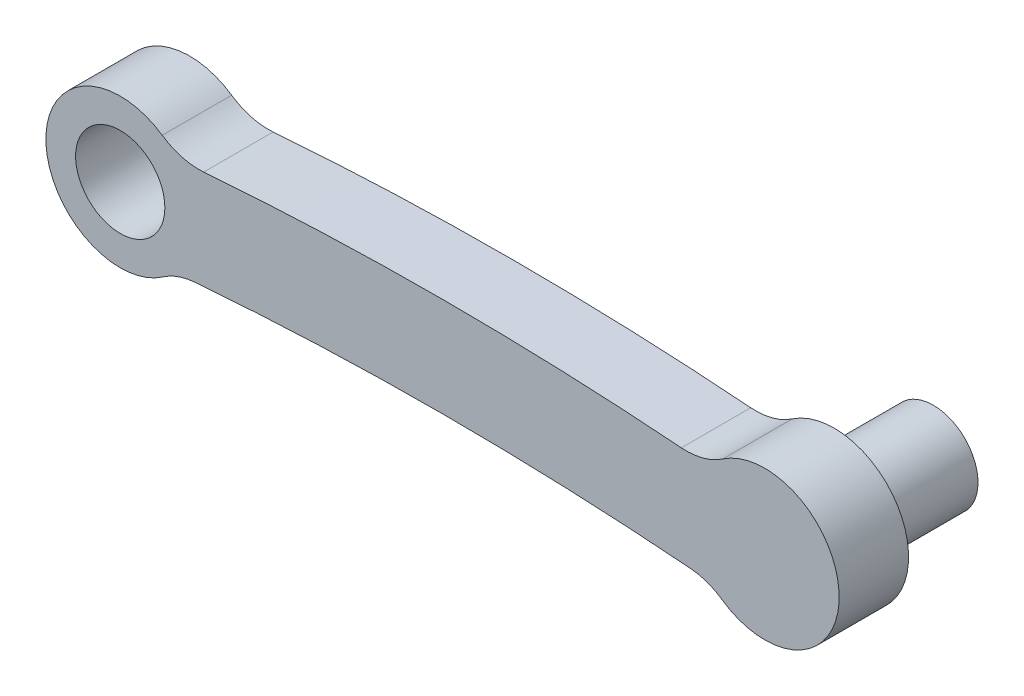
ISO-10303-21;
HEADER;
FILE_DESCRIPTION(('STEP AP214'),'2;1');
FILE_NAME('part.step','',(''),(''),'','','');
FILE_SCHEMA(('AUTOMOTIVE_DESIGN { 1 0 10303 214 1 1 1 1 }'));
ENDSEC;
DATA;
#1=APPLICATION_CONTEXT('core data for automotive mechanical design processes');
#2=APPLICATION_PROTOCOL_DEFINITION('international standard','automotive_design',2000,#1);
#3=PRODUCT_CONTEXT('',#1,'mechanical');
#4=PRODUCT('Part','Part','',(#3));
#5=PRODUCT_RELATED_PRODUCT_CATEGORY('part','',(#4));
#6=PRODUCT_DEFINITION_FORMATION('','',#4);
#7=PRODUCT_DEFINITION_CONTEXT('part definition',#1,'design');
#8=PRODUCT_DEFINITION('design','',#6,#7);
#9=PRODUCT_DEFINITION_SHAPE('','',#8);
#10=(LENGTH_UNIT() NAMED_UNIT(*) SI_UNIT(.MILLI.,.METRE.));
#11=(NAMED_UNIT(*) PLANE_ANGLE_UNIT() SI_UNIT($,.RADIAN.));
#12=(NAMED_UNIT(*) SI_UNIT($,.STERADIAN.) SOLID_ANGLE_UNIT());
#13=UNCERTAINTY_MEASURE_WITH_UNIT(LENGTH_MEASURE(1.E-05),#10,'distance_accuracy_value','');
#14=(GEOMETRIC_REPRESENTATION_CONTEXT(3) GLOBAL_UNCERTAINTY_ASSIGNED_CONTEXT((#13)) GLOBAL_UNIT_ASSIGNED_CONTEXT((#10,
#11,#12)) REPRESENTATION_CONTEXT('',''));
#15=CARTESIAN_POINT('',(0.,0.,0.));
#16=DIRECTION('',(0.,0.,1.));
#17=DIRECTION('',(1.,0.,0.));
#18=AXIS2_PLACEMENT_3D('',#15,#16,#17);
#19=CARTESIAN_POINT('',(-344.87892941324,59.7384303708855,48.1847067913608));
#20=DIRECTION('',(0.,0.,-1.));
#21=DIRECTION('',(-1.,0.,0.));
#22=AXIS2_PLACEMENT_3D('',#19,#20,#21);
#23=CYLINDRICAL_SURFACE('',#22,32.6041666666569);
#24=CARTESIAN_POINT('',(-344.87892941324,59.7384303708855,13.1847067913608));
#25=DIRECTION('',(0.,0.,1.));
#26=DIRECTION('',(1.,0.,0.));
#27=AXIS2_PLACEMENT_3D('',#24,#25,#26);
#28=CIRCLE('',#27,32.6041666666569);
#29=CARTESIAN_POINT('',(-363.28298745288,32.8251932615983,13.1847067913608));
#30=VERTEX_POINT('',#29);
#31=CARTESIAN_POINT('',(-342.370187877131,27.2309250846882,13.1847067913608));
#32=VERTEX_POINT('',#31);
#33=EDGE_CURVE('E150',#30,#32,#28,.T.);
#34=ORIENTED_EDGE('',*,*,#33,.F.);
#35=DIRECTION('',(0.,0.,-1.));
#36=VECTOR('',#35,1.);
#37=CARTESIAN_POINT('',(-363.28298745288,32.8251932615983,48.1847067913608));
#38=LINE('',#37,#36);
#39=CARTESIAN_POINT('',(-363.28298745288,32.8251932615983,48.1847067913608));
#40=VERTEX_POINT('',#39);
#41=EDGE_CURVE('E60',#40,#30,#38,.T.);
#42=ORIENTED_EDGE('',*,*,#41,.F.);
#43=CARTESIAN_POINT('',(-344.87892941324,59.7384303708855,48.1847067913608));
#44=DIRECTION('',(0.,0.,1.));
#45=DIRECTION('',(1.,0.,0.));
#46=AXIS2_PLACEMENT_3D('',#43,#44,#45);
#47=CIRCLE('',#46,32.6041666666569);
#48=CARTESIAN_POINT('',(-342.370187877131,27.2309250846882,48.1847067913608));
#49=VERTEX_POINT('',#48);
#50=EDGE_CURVE('E174',#40,#49,#47,.T.);
#51=ORIENTED_EDGE('',*,*,#50,.T.);
#52=DIRECTION('',(0.,0.,-1.));
#53=VECTOR('',#52,1.);
#54=CARTESIAN_POINT('',(-342.370187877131,27.2309250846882,48.1847067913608));
#55=LINE('',#54,#53);
#56=EDGE_CURVE('E68',#49,#32,#55,.T.);
#57=ORIENTED_EDGE('',*,*,#56,.T.);
#58=EDGE_LOOP('',(#34,#42,#51,#57));
#59=FACE_BOUND('',#58,.T.);
#60=ADVANCED_FACE('F52',(#59),#23,.F.);
#61=CARTESIAN_POINT('',(-384.450594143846,1.87067134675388,48.1847067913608));
#62=DIRECTION('',(0.,0.,-1.));
#63=DIRECTION('',(-1.,0.,0.));
#64=AXIS2_PLACEMENT_3D('',#61,#62,#63);
#65=CYLINDRICAL_SURFACE('',#64,37.5);
#66=CARTESIAN_POINT('',(-384.450594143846,1.87067134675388,13.1847067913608));
#67=DIRECTION('',(0.,0.,1.));
#68=DIRECTION('',(1.,0.,0.));
#69=AXIS2_PLACEMENT_3D('',#66,#67,#68);
#70=CIRCLE('',#69,37.5);
#71=CARTESIAN_POINT('',(-362.998142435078,-28.8871295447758,13.1847067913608));
#72=VERTEX_POINT('',#71);
#73=EDGE_CURVE('E152',#30,#72,#70,.T.);
#74=ORIENTED_EDGE('',*,*,#73,.T.);
#75=DIRECTION('',(0.,0.,-1.));
#76=VECTOR('',#75,1.);
#77=CARTESIAN_POINT('',(-362.998142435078,-28.8871295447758,48.1847067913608));
#78=LINE('',#77,#76);
#79=CARTESIAN_POINT('',(-362.998142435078,-28.8871295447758,48.1847067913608));
#80=VERTEX_POINT('',#79);
#81=EDGE_CURVE('E182',#80,#72,#78,.T.);
#82=ORIENTED_EDGE('',*,*,#81,.F.);
#83=CARTESIAN_POINT('',(-384.450594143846,1.87067134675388,48.1847067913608));
#84=DIRECTION('',(0.,0.,1.));
#85=DIRECTION('',(1.,0.,0.));
#86=AXIS2_PLACEMENT_3D('',#83,#84,#85);
#87=CIRCLE('',#86,37.5);
#88=EDGE_CURVE('E187',#40,#80,#87,.T.);
#89=ORIENTED_EDGE('',*,*,#88,.F.);
#90=ORIENTED_EDGE('',*,*,#41,.T.);
#91=EDGE_LOOP('',(#74,#82,#89,#90));
#92=FACE_BOUND('',#91,.T.);
#93=ADVANCED_FACE('F185',(#92),#65,.T.);
#94=CARTESIAN_POINT('',(-344.346427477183,-55.6293286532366,48.1847067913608));
#95=DIRECTION('',(0.,0.,-1.));
#96=DIRECTION('',(-1.,0.,0.));
#97=AXIS2_PLACEMENT_3D('',#94,#95,#96);
#98=CYLINDRICAL_SURFACE('',#97,32.6041666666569);
#99=CARTESIAN_POINT('',(-344.346427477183,-55.6293286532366,13.1847067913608));
#100=DIRECTION('',(0.,0.,1.));
#101=DIRECTION('',(1.,0.,0.));
#102=AXIS2_PLACEMENT_3D('',#99,#100,#101);
#103=CIRCLE('',#102,32.6041666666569);
#104=CARTESIAN_POINT('',(-346.950594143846,-23.129328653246,13.1847067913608));
#105=VERTEX_POINT('',#104);
#106=EDGE_CURVE('E156',#105,#72,#103,.T.);
#107=ORIENTED_EDGE('',*,*,#106,.F.);
#108=DIRECTION('',(0.,0.,-1.));
#109=VECTOR('',#108,1.);
#110=CARTESIAN_POINT('',(-346.950594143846,-23.129328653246,48.1847067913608));
#111=LINE('',#110,#109);
#112=CARTESIAN_POINT('',(-346.950594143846,-23.129328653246,48.1847067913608));
#113=VERTEX_POINT('',#112);
#114=EDGE_CURVE('E180',#113,#105,#111,.T.);
#115=ORIENTED_EDGE('',*,*,#114,.F.);
#116=CARTESIAN_POINT('',(-344.346427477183,-55.6293286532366,48.1847067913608));
#117=DIRECTION('',(0.,0.,1.));
#118=DIRECTION('',(1.,0.,0.));
#119=AXIS2_PLACEMENT_3D('',#116,#117,#118);
#120=CIRCLE('',#119,32.6041666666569);
#121=EDGE_CURVE('E243',#113,#80,#120,.T.);
#122=ORIENTED_EDGE('',*,*,#121,.T.);
#123=ORIENTED_EDGE('',*,*,#81,.T.);
#124=EDGE_LOOP('',(#107,#115,#122,#123));
#125=FACE_BOUND('',#124,.T.);
#126=ADVANCED_FACE('F197',(#125),#98,.F.);
#127=CARTESIAN_POINT('',(-221.950594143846,-1583.12932865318,48.1847067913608));
#128=DIRECTION('',(0.,0.,-1.));
#129=DIRECTION('',(-1.,0.,0.));
#130=AXIS2_PLACEMENT_3D('',#127,#128,#129);
#131=CYLINDRICAL_SURFACE('',#130,1564.99999999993);
#132=CARTESIAN_POINT('',(-221.950594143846,-1583.12932865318,13.1847067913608));
#133=DIRECTION('',(0.,0.,1.));
#134=DIRECTION('',(1.,0.,0.));
#135=AXIS2_PLACEMENT_3D('',#132,#133,#134);
#136=CIRCLE('',#135,1564.99999999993);
#137=CARTESIAN_POINT('',(-96.950594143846,-23.129328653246,13.1847067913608));
#138=VERTEX_POINT('',#137);
#139=EDGE_CURVE('E159',#105,#138,#136,.F.);
#140=ORIENTED_EDGE('',*,*,#139,.T.);
#141=DIRECTION('',(0.,0.,-1.));
#142=VECTOR('',#141,1.);
#143=CARTESIAN_POINT('',(-96.950594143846,-23.129328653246,48.1847067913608));
#144=LINE('',#143,#142);
#145=CARTESIAN_POINT('',(-96.950594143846,-23.129328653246,48.1847067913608));
#146=VERTEX_POINT('',#145);
#147=EDGE_CURVE('E178',#146,#138,#144,.T.);
#148=ORIENTED_EDGE('',*,*,#147,.F.);
#149=CARTESIAN_POINT('',(-221.950594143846,-1583.12932865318,48.1847067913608));
#150=DIRECTION('',(0.,0.,1.));
#151=DIRECTION('',(1.,0.,0.));
#152=AXIS2_PLACEMENT_3D('',#149,#150,#151);
#153=CIRCLE('',#152,1564.99999999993);
#154=EDGE_CURVE('E246',#113,#146,#153,.F.);
#155=ORIENTED_EDGE('',*,*,#154,.F.);
#156=ORIENTED_EDGE('',*,*,#114,.T.);
#157=EDGE_LOOP('',(#140,#148,#155,#156));
#158=FACE_BOUND('',#157,.T.);
#159=ADVANCED_FACE('F201',(#158),#131,.F.);
#160=CARTESIAN_POINT('',(-99.5547608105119,-55.6293286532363,48.1847067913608));
#161=DIRECTION('',(0.,0.,-1.));
#162=DIRECTION('',(-1.,0.,0.));
#163=AXIS2_PLACEMENT_3D('',#160,#161,#162);
#164=CYLINDRICAL_SURFACE('',#163,32.6041666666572);
#165=CARTESIAN_POINT('',(-99.5547608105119,-55.6293286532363,13.1847067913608));
#166=DIRECTION('',(0.,0.,1.));
#167=DIRECTION('',(1.,0.,0.));
#168=AXIS2_PLACEMENT_3D('',#165,#166,#167);
#169=CIRCLE('',#168,32.6041666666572);
#170=CARTESIAN_POINT('',(-80.903045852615,-28.8871295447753,13.1847067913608));
#171=VERTEX_POINT('',#170);
#172=EDGE_CURVE('E162',#171,#138,#169,.T.);
#173=ORIENTED_EDGE('',*,*,#172,.F.);
#174=DIRECTION('',(0.,0.,-1.));
#175=VECTOR('',#174,1.);
#176=CARTESIAN_POINT('',(-80.903045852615,-28.8871295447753,48.1847067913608));
#177=LINE('',#176,#175);
#178=CARTESIAN_POINT('',(-80.903045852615,-28.8871295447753,48.1847067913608));
#179=VERTEX_POINT('',#178);
#180=EDGE_CURVE('E139',#179,#171,#177,.T.);
#181=ORIENTED_EDGE('',*,*,#180,.F.);
#182=CARTESIAN_POINT('',(-99.5547608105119,-55.6293286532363,48.1847067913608));
#183=DIRECTION('',(0.,0.,1.));
#184=DIRECTION('',(1.,0.,0.));
#185=AXIS2_PLACEMENT_3D('',#182,#183,#184);
#186=CIRCLE('',#185,32.6041666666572);
#187=EDGE_CURVE('E129',#179,#146,#186,.T.);
#188=ORIENTED_EDGE('',*,*,#187,.T.);
#189=ORIENTED_EDGE('',*,*,#147,.T.);
#190=EDGE_LOOP('',(#173,#181,#188,#189));
#191=FACE_BOUND('',#190,.T.);
#192=ADVANCED_FACE('F207',(#191),#164,.F.);
#193=CARTESIAN_POINT('',(-59.4505941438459,1.87067134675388,48.1847067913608));
#194=DIRECTION('',(0.,0.,-1.));
#195=DIRECTION('',(-1.,0.,0.));
#196=AXIS2_PLACEMENT_3D('',#193,#194,#195);
#197=CYLINDRICAL_SURFACE('',#196,37.5);
#198=CARTESIAN_POINT('',(-59.4505941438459,1.87067134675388,13.1847067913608));
#199=DIRECTION('',(0.,0.,1.));
#200=DIRECTION('',(1.,0.,0.));
#201=AXIS2_PLACEMENT_3D('',#198,#199,#200);
#202=CIRCLE('',#201,37.5);
#203=CARTESIAN_POINT('',(-80.6182008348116,32.8251932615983,13.1847067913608));
#204=VERTEX_POINT('',#203);
#205=EDGE_CURVE('E136',#171,#204,#202,.T.);
#206=ORIENTED_EDGE('',*,*,#205,.T.);
#207=DIRECTION('',(0.,0.,-1.));
#208=VECTOR('',#207,1.);
#209=CARTESIAN_POINT('',(-80.6182008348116,32.8251932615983,48.1847067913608));
#210=LINE('',#209,#208);
#211=CARTESIAN_POINT('',(-80.6182008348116,32.8251932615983,48.1847067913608));
#212=VERTEX_POINT('',#211);
#213=EDGE_CURVE('E133',#212,#204,#210,.T.);
#214=ORIENTED_EDGE('',*,*,#213,.F.);
#215=CARTESIAN_POINT('',(-59.4505941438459,1.87067134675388,48.1847067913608));
#216=DIRECTION('',(0.,0.,1.));
#217=DIRECTION('',(1.,0.,0.));
#218=AXIS2_PLACEMENT_3D('',#215,#216,#217);
#219=CIRCLE('',#218,37.5);
#220=EDGE_CURVE('E120',#179,#212,#219,.T.);
#221=ORIENTED_EDGE('',*,*,#220,.F.);
#222=ORIENTED_EDGE('',*,*,#180,.T.);
#223=EDGE_LOOP('',(#206,#214,#221,#222));
#224=FACE_BOUND('',#223,.T.);
#225=ADVANCED_FACE('F134',(#224),#197,.T.);
#226=CARTESIAN_POINT('',(-99.0222588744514,59.7384303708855,48.1847067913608));
#227=DIRECTION('',(0.,0.,-1.));
#228=DIRECTION('',(-1.,0.,0.));
#229=AXIS2_PLACEMENT_3D('',#226,#227,#228);
#230=CYLINDRICAL_SURFACE('',#229,32.604166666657);
#231=CARTESIAN_POINT('',(-99.0222588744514,59.7384303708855,13.1847067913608));
#232=DIRECTION('',(0.,0.,1.));
#233=DIRECTION('',(1.,0.,0.));
#234=AXIS2_PLACEMENT_3D('',#231,#232,#233);
#235=CIRCLE('',#234,32.604166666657);
#236=CARTESIAN_POINT('',(-101.531000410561,27.2309250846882,13.1847067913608));
#237=VERTEX_POINT('',#236);
#238=EDGE_CURVE('E166',#237,#204,#235,.T.);
#239=ORIENTED_EDGE('',*,*,#238,.F.);
#240=DIRECTION('',(0.,0.,-1.));
#241=VECTOR('',#240,1.);
#242=CARTESIAN_POINT('',(-101.531000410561,27.2309250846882,48.1847067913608));
#243=LINE('',#242,#241);
#244=CARTESIAN_POINT('',(-101.531000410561,27.2309250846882,48.1847067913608));
#245=VERTEX_POINT('',#244);
#246=EDGE_CURVE('E94',#245,#237,#243,.T.);
#247=ORIENTED_EDGE('',*,*,#246,.F.);
#248=CARTESIAN_POINT('',(-99.0222588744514,59.7384303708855,48.1847067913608));
#249=DIRECTION('',(0.,0.,1.));
#250=DIRECTION('',(1.,0.,0.));
#251=AXIS2_PLACEMENT_3D('',#248,#249,#250);
#252=CIRCLE('',#251,32.604166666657);
#253=EDGE_CURVE('E127',#245,#212,#252,.T.);
#254=ORIENTED_EDGE('',*,*,#253,.T.);
#255=ORIENTED_EDGE('',*,*,#213,.T.);
#256=EDGE_LOOP('',(#239,#247,#254,#255));
#257=FACE_BOUND('',#256,.T.);
#258=ADVANCED_FACE('F141',(#257),#230,.F.);
#259=CARTESIAN_POINT('',(-221.950594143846,-1533.12932865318,48.1847067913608));
#260=DIRECTION('',(0.,0.,-1.));
#261=DIRECTION('',(-1.,0.,0.));
#262=AXIS2_PLACEMENT_3D('',#259,#260,#261);
#263=CYLINDRICAL_SURFACE('',#262,1564.99999999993);
#264=CARTESIAN_POINT('',(-221.950594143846,-1533.12932865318,13.1847067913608));
#265=DIRECTION('',(0.,0.,1.));
#266=DIRECTION('',(1.,0.,0.));
#267=AXIS2_PLACEMENT_3D('',#264,#265,#266);
#268=CIRCLE('',#267,1564.99999999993);
#269=EDGE_CURVE('E168',#32,#237,#268,.F.);
#270=ORIENTED_EDGE('',*,*,#269,.F.);
#271=ORIENTED_EDGE('',*,*,#56,.F.);
#272=CARTESIAN_POINT('',(-221.950594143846,-1533.12932865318,48.1847067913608));
#273=DIRECTION('',(0.,0.,1.));
#274=DIRECTION('',(1.,0.,0.));
#275=AXIS2_PLACEMENT_3D('',#272,#273,#274);
#276=CIRCLE('',#275,1564.99999999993);
#277=EDGE_CURVE('E142',#49,#245,#276,.F.);
#278=ORIENTED_EDGE('',*,*,#277,.T.);
#279=ORIENTED_EDGE('',*,*,#246,.T.);
#280=EDGE_LOOP('',(#270,#271,#278,#279));
#281=FACE_BOUND('',#280,.T.);
#282=ADVANCED_FACE('F216',(#281),#263,.T.);
#283=CARTESIAN_POINT('',(-384.450594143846,1.87067134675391,48.1847067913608));
#284=DIRECTION('',(0.,0.,-1.));
#285=DIRECTION('',(-1.,0.,0.));
#286=AXIS2_PLACEMENT_3D('',#283,#284,#285);
#287=CYLINDRICAL_SURFACE('',#286,22.5);
#288=CARTESIAN_POINT('',(-384.450594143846,1.87067134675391,48.1847067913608));
#289=DIRECTION('',(0.,0.,1.));
#290=DIRECTION('',(1.,0.,0.));
#291=AXIS2_PLACEMENT_3D('',#288,#289,#290);
#292=CIRCLE('',#291,22.5);
#293=CARTESIAN_POINT('',(-361.950594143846,1.87067134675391,48.1847067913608));
#294=VERTEX_POINT('',#293);
#295=EDGE_CURVE('E144',#294,#294,#292,.T.);
#296=ORIENTED_EDGE('',*,*,#295,.T.);
#297=EDGE_LOOP('',(#296));
#298=FACE_BOUND('',#297,.T.);
#299=CARTESIAN_POINT('',(-384.450594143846,1.87067134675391,13.1847067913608));
#300=DIRECTION('',(0.,0.,1.));
#301=DIRECTION('',(1.,0.,0.));
#302=AXIS2_PLACEMENT_3D('',#299,#300,#301);
#303=CIRCLE('',#302,22.5);
#304=CARTESIAN_POINT('',(-361.950594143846,1.87067134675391,13.1847067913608));
#305=VERTEX_POINT('',#304);
#306=EDGE_CURVE('E171',#305,#305,#303,.T.);
#307=ORIENTED_EDGE('',*,*,#306,.F.);
#308=EDGE_LOOP('',(#307));
#309=FACE_BOUND('',#308,.T.);
#310=ADVANCED_FACE('F219',(#298,#309),#287,.F.);
#311=CARTESIAN_POINT('',(-96.9505941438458,1.87067134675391,48.1847067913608));
#312=DIRECTION('',(0.,0.,1.));
#313=DIRECTION('',(1.,0.,0.));
#314=AXIS2_PLACEMENT_3D('',#311,#312,#313);
#315=PLANE('',#314);
#316=ORIENTED_EDGE('',*,*,#50,.F.);
#317=ORIENTED_EDGE('',*,*,#88,.T.);
#318=ORIENTED_EDGE('',*,*,#121,.F.);
#319=ORIENTED_EDGE('',*,*,#154,.T.);
#320=ORIENTED_EDGE('',*,*,#187,.F.);
#321=ORIENTED_EDGE('',*,*,#220,.T.);
#322=ORIENTED_EDGE('',*,*,#253,.F.);
#323=ORIENTED_EDGE('',*,*,#277,.F.);
#324=EDGE_LOOP('',(#316,#317,#318,#319,#320,#321,#322,#323));
#325=FACE_BOUND('',#324,.T.);
#326=ORIENTED_EDGE('',*,*,#295,.F.);
#327=EDGE_LOOP('',(#326));
#328=FACE_BOUND('',#327,.T.);
#329=ADVANCED_FACE('F123',(#325,#328),#315,.T.);
#330=CARTESIAN_POINT('',(-96.9505941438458,1.87067134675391,13.1847067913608));
#331=DIRECTION('',(0.,0.,1.));
#332=DIRECTION('',(1.,0.,0.));
#333=AXIS2_PLACEMENT_3D('',#330,#331,#332);
#334=PLANE('',#333);
#335=CARTESIAN_POINT('',(-59.4505941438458,1.87067134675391,13.1847067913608));
#336=DIRECTION('',(0.,0.,1.));
#337=DIRECTION('',(1.,0.,0.));
#338=AXIS2_PLACEMENT_3D('',#335,#336,#337);
#339=CIRCLE('',#338,22.5);
#340=CARTESIAN_POINT('',(-36.9505941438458,1.87067134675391,13.1847067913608));
#341=VERTEX_POINT('',#340);
#342=EDGE_CURVE('E12',#341,#341,#339,.F.);
#343=ORIENTED_EDGE('',*,*,#342,.F.);
#344=EDGE_LOOP('',(#343));
#345=FACE_BOUND('',#344,.T.);
#346=ORIENTED_EDGE('',*,*,#33,.T.);
#347=ORIENTED_EDGE('',*,*,#269,.T.);
#348=ORIENTED_EDGE('',*,*,#238,.T.);
#349=ORIENTED_EDGE('',*,*,#205,.F.);
#350=ORIENTED_EDGE('',*,*,#172,.T.);
#351=ORIENTED_EDGE('',*,*,#139,.F.);
#352=ORIENTED_EDGE('',*,*,#106,.T.);
#353=ORIENTED_EDGE('',*,*,#73,.F.);
#354=EDGE_LOOP('',(#346,#347,#348,#349,#350,#351,#352,#353));
#355=FACE_BOUND('',#354,.T.);
#356=ORIENTED_EDGE('',*,*,#306,.T.);
#357=EDGE_LOOP('',(#356));
#358=FACE_BOUND('',#357,.T.);
#359=ADVANCED_FACE('F189',(#345,#355,#358),#334,.F.);
#360=CARTESIAN_POINT('',(-59.4505941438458,1.87067134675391,-36.8152932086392));
#361=DIRECTION('',(0.,0.,1.));
#362=DIRECTION('',(1.,0.,0.));
#363=AXIS2_PLACEMENT_3D('',#360,#361,#362);
#364=CYLINDRICAL_SURFACE('',#363,22.5);
#365=CARTESIAN_POINT('',(-59.4505941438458,1.87067134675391,-36.8152932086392));
#366=DIRECTION('',(0.,0.,-1.));
#367=DIRECTION('',(-1.,0.,0.));
#368=AXIS2_PLACEMENT_3D('',#365,#366,#367);
#369=CIRCLE('',#368,22.5);
#370=CARTESIAN_POINT('',(-81.9505941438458,1.87067134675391,-36.8152932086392));
#371=VERTEX_POINT('',#370);
#372=EDGE_CURVE('E153',#371,#371,#369,.T.);
#373=ORIENTED_EDGE('',*,*,#372,.F.);
#374=EDGE_LOOP('',(#373));
#375=FACE_BOUND('',#374,.T.);
#376=ORIENTED_EDGE('',*,*,#342,.T.);
#377=EDGE_LOOP('',(#376));
#378=FACE_BOUND('',#377,.T.);
#379=ADVANCED_FACE('F225',(#375,#378),#364,.T.);
#380=CARTESIAN_POINT('',(-59.4505941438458,1.87067134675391,-36.8152932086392));
#381=DIRECTION('',(0.,0.,-1.));
#382=DIRECTION('',(-1.,0.,0.));
#383=AXIS2_PLACEMENT_3D('',#380,#381,#382);
#384=PLANE('',#383);
#385=ORIENTED_EDGE('',*,*,#372,.T.);
#386=EDGE_LOOP('',(#385));
#387=FACE_BOUND('',#386,.T.);
#388=ADVANCED_FACE('F231',(#387),#384,.T.);
#389=CLOSED_SHELL('',(#60,#93,#126,#159,#192,#225,#258,#282,#310,#329,#359,#379,#388));
#390=MANIFOLD_SOLID_BREP('B2',#389);
#391=ADVANCED_BREP_SHAPE_REPRESENTATION('',(#18,#390),#14);
#392=SHAPE_DEFINITION_REPRESENTATION(#9,#391);
ENDSEC;
END-ISO-10303-21;
